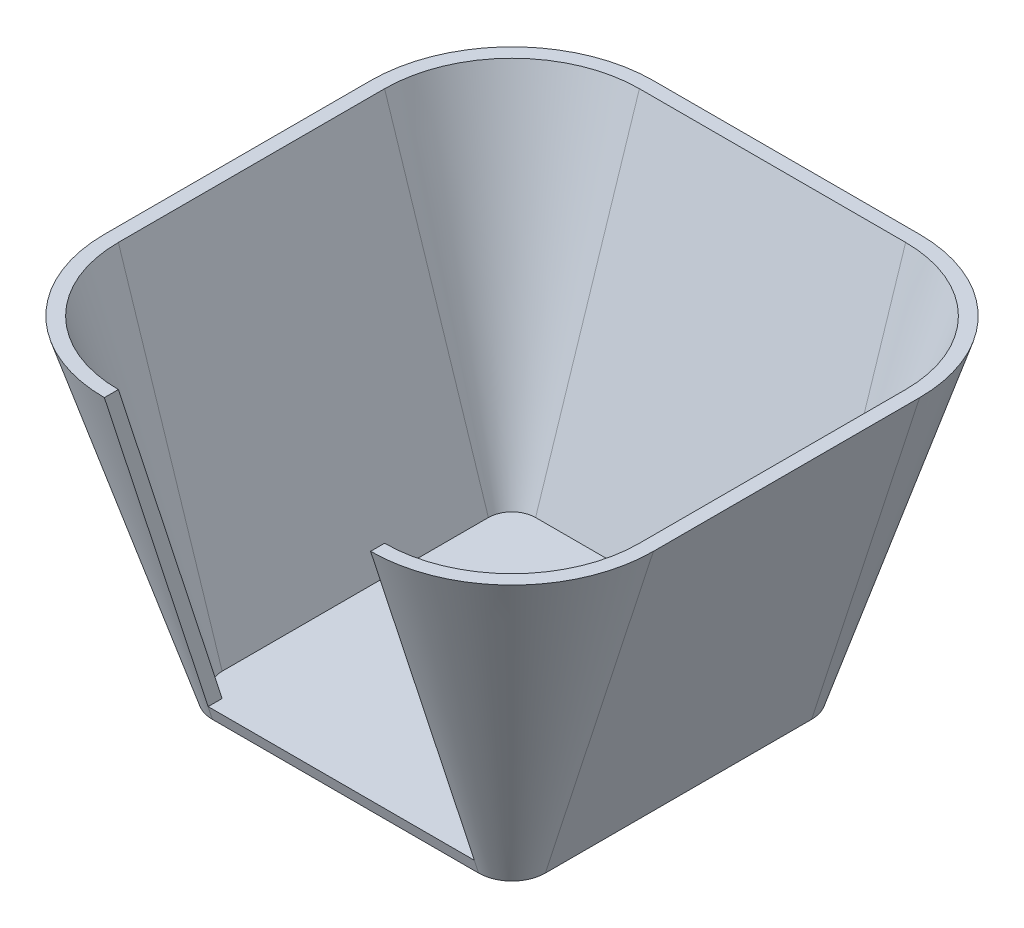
ISO-10303-21;
HEADER;
FILE_DESCRIPTION(('STEP AP214'),'2;1');
FILE_NAME('part.step','',(''),(''),'','','');
FILE_SCHEMA(('AUTOMOTIVE_DESIGN { 1 0 10303 214 1 1 1 1 }'));
ENDSEC;
DATA;
#1=APPLICATION_CONTEXT('core data for automotive mechanical design processes');
#2=APPLICATION_PROTOCOL_DEFINITION('international standard','automotive_design',2000,#1);
#3=PRODUCT_CONTEXT('',#1,'mechanical');
#4=PRODUCT('Part','Part','',(#3));
#5=PRODUCT_RELATED_PRODUCT_CATEGORY('part','',(#4));
#6=PRODUCT_DEFINITION_FORMATION('','',#4);
#7=PRODUCT_DEFINITION_CONTEXT('part definition',#1,'design');
#8=PRODUCT_DEFINITION('design','',#6,#7);
#9=PRODUCT_DEFINITION_SHAPE('','',#8);
#10=(LENGTH_UNIT() NAMED_UNIT(*) SI_UNIT(.MILLI.,.METRE.));
#11=(NAMED_UNIT(*) PLANE_ANGLE_UNIT() SI_UNIT($,.RADIAN.));
#12=(NAMED_UNIT(*) SI_UNIT($,.STERADIAN.) SOLID_ANGLE_UNIT());
#13=UNCERTAINTY_MEASURE_WITH_UNIT(LENGTH_MEASURE(1.E-05),#10,'distance_accuracy_value','');
#14=(GEOMETRIC_REPRESENTATION_CONTEXT(3) GLOBAL_UNCERTAINTY_ASSIGNED_CONTEXT((#13)) GLOBAL_UNIT_ASSIGNED_CONTEXT((#10,
#11,#12)) REPRESENTATION_CONTEXT('',''));
#15=CARTESIAN_POINT('',(0.,0.,0.));
#16=DIRECTION('',(0.,0.,1.));
#17=DIRECTION('',(1.,0.,0.));
#18=AXIS2_PLACEMENT_3D('',#15,#16,#17);
#19=CARTESIAN_POINT('',(-20.,0.,25.));
#20=DIRECTION('',(0.,-0.309016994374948,0.951056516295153));
#21=DIRECTION('',(0.,-0.951056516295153,-0.309016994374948));
#22=AXIS2_PLACEMENT_3D('',#19,#20,#21);
#23=PLANE('',#22);
#24=DIRECTION('',(-1.,0.,0.));
#25=VECTOR('',#24,1.);
#26=CARTESIAN_POINT('',(-20.,2.,25.6498393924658));
#27=LINE('',#26,#25);
#28=CARTESIAN_POINT('',(-20.,2.,25.6498393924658));
#29=VERTEX_POINT('',#28);
#30=CARTESIAN_POINT('',(20.,2.,25.6498393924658));
#31=VERTEX_POINT('',#30);
#32=EDGE_CURVE('E256',#29,#31,#27,.F.);
#33=ORIENTED_EDGE('',*,*,#32,.F.);
#34=DIRECTION('',(0.,0.951056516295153,0.309016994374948));
#35=VECTOR('',#34,1.);
#36=CARTESIAN_POINT('',(-20.,0.,25.));
#37=LINE('',#36,#35);
#38=CARTESIAN_POINT('',(-20.,0.,25.));
#39=VERTEX_POINT('',#38);
#40=EDGE_CURVE('E189',#29,#39,#37,.F.);
#41=ORIENTED_EDGE('',*,*,#40,.T.);
#42=DIRECTION('',(1.,0.,0.));
#43=VECTOR('',#42,1.);
#44=CARTESIAN_POINT('',(-20.,0.,25.));
#45=LINE('',#44,#43);
#46=CARTESIAN_POINT('',(20.,0.,25.));
#47=VERTEX_POINT('',#46);
#48=EDGE_CURVE('E226',#39,#47,#45,.T.);
#49=ORIENTED_EDGE('',*,*,#48,.T.);
#50=DIRECTION('',(0.,0.951056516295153,0.309016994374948));
#51=VECTOR('',#50,1.);
#52=CARTESIAN_POINT('',(20.,0.,25.));
#53=LINE('',#52,#51);
#54=EDGE_CURVE('E181',#31,#47,#53,.F.);
#55=ORIENTED_EDGE('',*,*,#54,.F.);
#56=EDGE_LOOP('',(#33,#41,#49,#55));
#57=FACE_BOUND('',#56,.T.);
#58=ADVANCED_FACE('F33',(#57),#23,.T.);
#59=CARTESIAN_POINT('',(-20.,0.,-20.));
#60=DIRECTION('',(0.,1.,0.));
#61=DIRECTION('',(0.,0.,1.));
#62=AXIS2_PLACEMENT_3D('',#59,#60,#61);
#63=CONICAL_SURFACE('',#62,5.,0.31415926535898);
#64=CARTESIAN_POINT('',(-20.,0.,-20.));
#65=DIRECTION('',(0.,1.,0.));
#66=DIRECTION('',(0.,0.,1.));
#67=AXIS2_PLACEMENT_3D('',#64,#65,#66);
#68=CIRCLE('',#67,5.);
#69=CARTESIAN_POINT('',(-20.,0.,-25.));
#70=VERTEX_POINT('',#69);
#71=CARTESIAN_POINT('',(-25.,0.,-20.));
#72=VERTEX_POINT('',#71);
#73=EDGE_CURVE('E218',#70,#72,#68,.T.);
#74=ORIENTED_EDGE('',*,*,#73,.T.);
#75=DIRECTION('',(-0.309016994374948,0.951056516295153,0.));
#76=VECTOR('',#75,1.);
#77=CARTESIAN_POINT('',(-25.,0.,-20.));
#78=LINE('',#77,#76);
#79=CARTESIAN_POINT('',(-41.2459848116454,50.,-20.));
#80=VERTEX_POINT('',#79);
#81=EDGE_CURVE('E11',#80,#72,#78,.F.);
#82=ORIENTED_EDGE('',*,*,#81,.F.);
#83=CARTESIAN_POINT('',(-20.,50.,-20.));
#84=DIRECTION('',(0.,1.,0.));
#85=DIRECTION('',(0.,0.,1.));
#86=AXIS2_PLACEMENT_3D('',#83,#84,#85);
#87=CIRCLE('',#86,21.2459848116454);
#88=CARTESIAN_POINT('',(-20.,50.,-41.2459848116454));
#89=VERTEX_POINT('',#88);
#90=EDGE_CURVE('E236',#89,#80,#87,.T.);
#91=ORIENTED_EDGE('',*,*,#90,.F.);
#92=DIRECTION('',(0.,0.951056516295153,-0.309016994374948));
#93=VECTOR('',#92,1.);
#94=CARTESIAN_POINT('',(-20.,0.,-25.));
#95=LINE('',#94,#93);
#96=EDGE_CURVE('E168',#89,#70,#95,.F.);
#97=ORIENTED_EDGE('',*,*,#96,.T.);
#98=EDGE_LOOP('',(#74,#82,#91,#97));
#99=FACE_BOUND('',#98,.T.);
#100=ADVANCED_FACE('F341',(#99),#63,.T.);
#101=CARTESIAN_POINT('',(-25.,0.,-20.));
#102=DIRECTION('',(-0.951056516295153,-0.309016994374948,0.));
#103=DIRECTION('',(0.309016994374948,-0.951056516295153,0.));
#104=AXIS2_PLACEMENT_3D('',#101,#102,#103);
#105=PLANE('',#104);
#106=DIRECTION('',(0.,0.,1.));
#107=VECTOR('',#106,1.);
#108=CARTESIAN_POINT('',(-25.,0.,-20.));
#109=LINE('',#108,#107);
#110=CARTESIAN_POINT('',(-25.,0.,20.));
#111=VERTEX_POINT('',#110);
#112=EDGE_CURVE('E221',#72,#111,#109,.T.);
#113=ORIENTED_EDGE('',*,*,#112,.T.);
#114=DIRECTION('',(-0.309016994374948,0.951056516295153,0.));
#115=VECTOR('',#114,1.);
#116=CARTESIAN_POINT('',(-25.,0.,20.));
#117=LINE('',#116,#115);
#118=CARTESIAN_POINT('',(-41.2459848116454,50.,20.));
#119=VERTEX_POINT('',#118);
#120=EDGE_CURVE('E43',#119,#111,#117,.F.);
#121=ORIENTED_EDGE('',*,*,#120,.F.);
#122=DIRECTION('',(0.,0.,-1.));
#123=VECTOR('',#122,1.);
#124=CARTESIAN_POINT('',(-41.2459848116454,50.,-20.));
#125=LINE('',#124,#123);
#126=EDGE_CURVE('E238',#80,#119,#125,.F.);
#127=ORIENTED_EDGE('',*,*,#126,.F.);
#128=ORIENTED_EDGE('',*,*,#81,.T.);
#129=EDGE_LOOP('',(#113,#121,#127,#128));
#130=FACE_BOUND('',#129,.T.);
#131=ADVANCED_FACE('F35',(#130),#105,.T.);
#132=CARTESIAN_POINT('',(-20.,0.,20.));
#133=DIRECTION('',(0.,1.,0.));
#134=DIRECTION('',(0.,0.,1.));
#135=AXIS2_PLACEMENT_3D('',#132,#133,#134);
#136=CONICAL_SURFACE('',#135,5.,0.31415926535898);
#137=CARTESIAN_POINT('',(-20.,0.,20.));
#138=DIRECTION('',(0.,1.,0.));
#139=DIRECTION('',(0.,0.,1.));
#140=AXIS2_PLACEMENT_3D('',#137,#138,#139);
#141=CIRCLE('',#140,5.);
#142=EDGE_CURVE('E223',#111,#39,#141,.T.);
#143=ORIENTED_EDGE('',*,*,#142,.T.);
#144=ORIENTED_EDGE('',*,*,#40,.F.);
#145=CARTESIAN_POINT('',(-20.,50.,41.2459848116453));
#146=VERTEX_POINT('',#145);
#147=EDGE_CURVE('E184',#146,#29,#37,.F.);
#148=ORIENTED_EDGE('',*,*,#147,.F.);
#149=CARTESIAN_POINT('',(-20.,50.,20.));
#150=DIRECTION('',(0.,1.,0.));
#151=DIRECTION('',(0.,0.,1.));
#152=AXIS2_PLACEMENT_3D('',#149,#150,#151);
#153=CIRCLE('',#152,21.2459848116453);
#154=EDGE_CURVE('E239',#119,#146,#153,.T.);
#155=ORIENTED_EDGE('',*,*,#154,.F.);
#156=ORIENTED_EDGE('',*,*,#120,.T.);
#157=EDGE_LOOP('',(#143,#144,#148,#155,#156));
#158=FACE_BOUND('',#157,.T.);
#159=ADVANCED_FACE('F248',(#158),#136,.T.);
#160=CARTESIAN_POINT('',(20.,0.,20.));
#161=DIRECTION('',(0.,1.,0.));
#162=DIRECTION('',(0.,0.,1.));
#163=AXIS2_PLACEMENT_3D('',#160,#161,#162);
#164=CONICAL_SURFACE('',#163,5.,0.31415926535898);
#165=CARTESIAN_POINT('',(20.,0.,20.));
#166=DIRECTION('',(0.,1.,0.));
#167=DIRECTION('',(0.,0.,1.));
#168=AXIS2_PLACEMENT_3D('',#165,#166,#167);
#169=CIRCLE('',#168,5.);
#170=CARTESIAN_POINT('',(25.,0.,20.));
#171=VERTEX_POINT('',#170);
#172=EDGE_CURVE('E229',#47,#171,#169,.T.);
#173=ORIENTED_EDGE('',*,*,#172,.T.);
#174=DIRECTION('',(0.309016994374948,0.951056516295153,0.));
#175=VECTOR('',#174,1.);
#176=CARTESIAN_POINT('',(25.,0.,20.));
#177=LINE('',#176,#175);
#178=CARTESIAN_POINT('',(41.2459848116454,50.,20.));
#179=VERTEX_POINT('',#178);
#180=EDGE_CURVE('E178',#179,#171,#177,.F.);
#181=ORIENTED_EDGE('',*,*,#180,.F.);
#182=CARTESIAN_POINT('',(20.,50.,20.));
#183=DIRECTION('',(0.,1.,0.));
#184=DIRECTION('',(0.,0.,1.));
#185=AXIS2_PLACEMENT_3D('',#182,#183,#184);
#186=CIRCLE('',#185,21.2459848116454);
#187=CARTESIAN_POINT('',(20.,50.,41.2459848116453));
#188=VERTEX_POINT('',#187);
#189=EDGE_CURVE('E190',#188,#179,#186,.T.);
#190=ORIENTED_EDGE('',*,*,#189,.F.);
#191=EDGE_CURVE('E185',#188,#31,#53,.F.);
#192=ORIENTED_EDGE('',*,*,#191,.T.);
#193=ORIENTED_EDGE('',*,*,#54,.T.);
#194=EDGE_LOOP('',(#173,#181,#190,#192,#193));
#195=FACE_BOUND('',#194,.T.);
#196=ADVANCED_FACE('F349',(#195),#164,.T.);
#197=CARTESIAN_POINT('',(25.,0.,-20.));
#198=DIRECTION('',(0.951056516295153,-0.309016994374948,0.));
#199=DIRECTION('',(0.309016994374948,0.951056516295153,0.));
#200=AXIS2_PLACEMENT_3D('',#197,#198,#199);
#201=PLANE('',#200);
#202=DIRECTION('',(0.,0.,-1.));
#203=VECTOR('',#202,1.);
#204=CARTESIAN_POINT('',(25.,0.,-20.));
#205=LINE('',#204,#203);
#206=CARTESIAN_POINT('',(25.,0.,-20.));
#207=VERTEX_POINT('',#206);
#208=EDGE_CURVE('E231',#171,#207,#205,.T.);
#209=ORIENTED_EDGE('',*,*,#208,.T.);
#210=DIRECTION('',(0.309016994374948,0.951056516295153,0.));
#211=VECTOR('',#210,1.);
#212=CARTESIAN_POINT('',(25.,0.,-20.));
#213=LINE('',#212,#211);
#214=CARTESIAN_POINT('',(41.2459848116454,50.,-20.));
#215=VERTEX_POINT('',#214);
#216=EDGE_CURVE('E167',#215,#207,#213,.F.);
#217=ORIENTED_EDGE('',*,*,#216,.F.);
#218=DIRECTION('',(0.,0.,1.));
#219=VECTOR('',#218,1.);
#220=CARTESIAN_POINT('',(41.2459848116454,50.,-20.));
#221=LINE('',#220,#219);
#222=EDGE_CURVE('E155',#179,#215,#221,.F.);
#223=ORIENTED_EDGE('',*,*,#222,.F.);
#224=ORIENTED_EDGE('',*,*,#180,.T.);
#225=EDGE_LOOP('',(#209,#217,#223,#224));
#226=FACE_BOUND('',#225,.T.);
#227=ADVANCED_FACE('F356',(#226),#201,.T.);
#228=CARTESIAN_POINT('',(20.,0.,-20.));
#229=DIRECTION('',(0.,1.,0.));
#230=DIRECTION('',(0.,0.,-1.));
#231=AXIS2_PLACEMENT_3D('',#228,#229,#230);
#232=CONICAL_SURFACE('',#231,5.,0.31415926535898);
#233=CARTESIAN_POINT('',(20.,0.,-20.));
#234=DIRECTION('',(0.,1.,0.));
#235=DIRECTION('',(0.,0.,-1.));
#236=AXIS2_PLACEMENT_3D('',#233,#234,#235);
#237=CIRCLE('',#236,5.);
#238=CARTESIAN_POINT('',(20.,0.,-25.));
#239=VERTEX_POINT('',#238);
#240=EDGE_CURVE('E164',#207,#239,#237,.T.);
#241=ORIENTED_EDGE('',*,*,#240,.T.);
#242=DIRECTION('',(0.,0.951056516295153,-0.309016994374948));
#243=VECTOR('',#242,1.);
#244=CARTESIAN_POINT('',(20.,0.,-25.));
#245=LINE('',#244,#243);
#246=CARTESIAN_POINT('',(20.,50.,-41.2459848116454));
#247=VERTEX_POINT('',#246);
#248=EDGE_CURVE('E161',#247,#239,#245,.F.);
#249=ORIENTED_EDGE('',*,*,#248,.F.);
#250=CARTESIAN_POINT('',(20.,50.,-20.));
#251=DIRECTION('',(0.,1.,0.));
#252=DIRECTION('',(0.,0.,1.));
#253=AXIS2_PLACEMENT_3D('',#250,#251,#252);
#254=CIRCLE('',#253,21.2459848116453);
#255=EDGE_CURVE('E146',#215,#247,#254,.T.);
#256=ORIENTED_EDGE('',*,*,#255,.F.);
#257=ORIENTED_EDGE('',*,*,#216,.T.);
#258=EDGE_LOOP('',(#241,#249,#256,#257));
#259=FACE_BOUND('',#258,.T.);
#260=ADVANCED_FACE('F162',(#259),#232,.T.);
#261=CARTESIAN_POINT('',(-20.,0.,-25.));
#262=DIRECTION('',(0.,-0.309016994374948,-0.951056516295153));
#263=DIRECTION('',(0.,0.951056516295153,-0.309016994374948));
#264=AXIS2_PLACEMENT_3D('',#261,#262,#263);
#265=PLANE('',#264);
#266=DIRECTION('',(-1.,0.,0.));
#267=VECTOR('',#266,1.);
#268=CARTESIAN_POINT('',(-20.,0.,-25.));
#269=LINE('',#268,#267);
#270=EDGE_CURVE('E234',#239,#70,#269,.T.);
#271=ORIENTED_EDGE('',*,*,#270,.T.);
#272=ORIENTED_EDGE('',*,*,#96,.F.);
#273=DIRECTION('',(1.,0.,0.));
#274=VECTOR('',#273,1.);
#275=CARTESIAN_POINT('',(-20.,50.,-41.2459848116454));
#276=LINE('',#275,#274);
#277=EDGE_CURVE('E152',#247,#89,#276,.F.);
#278=ORIENTED_EDGE('',*,*,#277,.F.);
#279=ORIENTED_EDGE('',*,*,#248,.T.);
#280=EDGE_LOOP('',(#271,#272,#278,#279));
#281=FACE_BOUND('',#280,.T.);
#282=ADVANCED_FACE('F170',(#281),#265,.T.);
#283=CARTESIAN_POINT('',(-20.,50.,-20.));
#284=DIRECTION('',(0.,1.,0.));
#285=DIRECTION('',(0.,0.,1.));
#286=AXIS2_PLACEMENT_3D('',#283,#284,#285);
#287=PLANE('',#286);
#288=DIRECTION('',(0.,0.,-1.));
#289=VECTOR('',#288,1.);
#290=CARTESIAN_POINT('',(-20.,50.,41.2459848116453));
#291=LINE('',#290,#289);
#292=CARTESIAN_POINT('',(-20.,50.,39.1430603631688));
#293=VERTEX_POINT('',#292);
#294=EDGE_CURVE('E37',#293,#146,#291,.F.);
#295=ORIENTED_EDGE('',*,*,#294,.F.);
#296=CARTESIAN_POINT('',(-20.,50.,20.));
#297=DIRECTION('',(0.,1.,0.));
#298=DIRECTION('',(0.,0.,1.));
#299=AXIS2_PLACEMENT_3D('',#296,#297,#298);
#300=CIRCLE('',#299,19.1430603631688);
#301=CARTESIAN_POINT('',(-39.1430603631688,50.,20.));
#302=VERTEX_POINT('',#301);
#303=EDGE_CURVE('E74',#302,#293,#300,.T.);
#304=ORIENTED_EDGE('',*,*,#303,.F.);
#305=DIRECTION('',(0.,0.,-1.));
#306=VECTOR('',#305,1.);
#307=CARTESIAN_POINT('',(-39.1430603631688,50.,-20.));
#308=LINE('',#307,#306);
#309=CARTESIAN_POINT('',(-39.1430603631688,50.,-20.));
#310=VERTEX_POINT('',#309);
#311=EDGE_CURVE('E83',#310,#302,#308,.F.);
#312=ORIENTED_EDGE('',*,*,#311,.F.);
#313=CARTESIAN_POINT('',(-20.,50.,-20.));
#314=DIRECTION('',(0.,1.,0.));
#315=DIRECTION('',(0.,0.,1.));
#316=AXIS2_PLACEMENT_3D('',#313,#314,#315);
#317=CIRCLE('',#316,19.1430603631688);
#318=CARTESIAN_POINT('',(-20.,50.,-39.1430603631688));
#319=VERTEX_POINT('',#318);
#320=EDGE_CURVE('E293',#319,#310,#317,.T.);
#321=ORIENTED_EDGE('',*,*,#320,.F.);
#322=DIRECTION('',(1.,0.,0.));
#323=VECTOR('',#322,1.);
#324=CARTESIAN_POINT('',(-20.,50.,-39.1430603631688));
#325=LINE('',#324,#323);
#326=CARTESIAN_POINT('',(20.,50.,-39.1430603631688));
#327=VERTEX_POINT('',#326);
#328=EDGE_CURVE('E273',#327,#319,#325,.F.);
#329=ORIENTED_EDGE('',*,*,#328,.F.);
#330=CARTESIAN_POINT('',(20.,50.,-20.));
#331=DIRECTION('',(0.,1.,0.));
#332=DIRECTION('',(0.,0.,1.));
#333=AXIS2_PLACEMENT_3D('',#330,#331,#332);
#334=CIRCLE('',#333,19.1430603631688);
#335=CARTESIAN_POINT('',(39.1430603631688,50.,-20.));
#336=VERTEX_POINT('',#335);
#337=EDGE_CURVE('E272',#336,#327,#334,.T.);
#338=ORIENTED_EDGE('',*,*,#337,.F.);
#339=DIRECTION('',(0.,0.,1.));
#340=VECTOR('',#339,1.);
#341=CARTESIAN_POINT('',(39.1430603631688,50.,-20.));
#342=LINE('',#341,#340);
#343=CARTESIAN_POINT('',(39.1430603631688,50.,20.));
#344=VERTEX_POINT('',#343);
#345=EDGE_CURVE('E217',#344,#336,#342,.F.);
#346=ORIENTED_EDGE('',*,*,#345,.F.);
#347=CARTESIAN_POINT('',(20.,50.,20.));
#348=DIRECTION('',(0.,1.,0.));
#349=DIRECTION('',(0.,0.,1.));
#350=AXIS2_PLACEMENT_3D('',#347,#348,#349);
#351=CIRCLE('',#350,19.1430603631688);
#352=CARTESIAN_POINT('',(20.,50.,39.1430603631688));
#353=VERTEX_POINT('',#352);
#354=EDGE_CURVE('E215',#353,#344,#351,.T.);
#355=ORIENTED_EDGE('',*,*,#354,.F.);
#356=DIRECTION('',(0.,0.,1.));
#357=VECTOR('',#356,1.);
#358=CARTESIAN_POINT('',(20.,50.,-20.));
#359=LINE('',#358,#357);
#360=EDGE_CURVE('E196',#353,#188,#359,.T.);
#361=ORIENTED_EDGE('',*,*,#360,.T.);
#362=ORIENTED_EDGE('',*,*,#189,.T.);
#363=ORIENTED_EDGE('',*,*,#222,.T.);
#364=ORIENTED_EDGE('',*,*,#255,.T.);
#365=ORIENTED_EDGE('',*,*,#277,.T.);
#366=ORIENTED_EDGE('',*,*,#90,.T.);
#367=ORIENTED_EDGE('',*,*,#126,.T.);
#368=ORIENTED_EDGE('',*,*,#154,.T.);
#369=EDGE_LOOP('',(#295,#304,#312,#321,#329,#338,#346,#355,#361,#362,#363,#364,#365,#366,#367,#368));
#370=FACE_BOUND('',#369,.T.);
#371=ADVANCED_FACE('F149',(#370),#287,.T.);
#372=CARTESIAN_POINT('',(-20.,0.,-20.));
#373=DIRECTION('',(0.,1.,0.));
#374=DIRECTION('',(0.,0.,1.));
#375=AXIS2_PLACEMENT_3D('',#372,#373,#374);
#376=PLANE('',#375);
#377=ORIENTED_EDGE('',*,*,#73,.F.);
#378=ORIENTED_EDGE('',*,*,#270,.F.);
#379=ORIENTED_EDGE('',*,*,#240,.F.);
#380=ORIENTED_EDGE('',*,*,#208,.F.);
#381=ORIENTED_EDGE('',*,*,#172,.F.);
#382=ORIENTED_EDGE('',*,*,#48,.F.);
#383=ORIENTED_EDGE('',*,*,#142,.F.);
#384=ORIENTED_EDGE('',*,*,#112,.F.);
#385=EDGE_LOOP('',(#377,#378,#379,#380,#381,#382,#383,#384));
#386=FACE_BOUND('',#385,.T.);
#387=ADVANCED_FACE('F366',(#386),#376,.F.);
#388=CARTESIAN_POINT('',(-20.,0.,25.));
#389=DIRECTION('',(1.,0.,0.));
#390=DIRECTION('',(0.,0.951056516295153,0.309016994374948));
#391=AXIS2_PLACEMENT_3D('',#388,#389,#390);
#392=PLANE('',#391);
#393=ORIENTED_EDGE('',*,*,#147,.T.);
#394=DIRECTION('',(0.,0.,-1.));
#395=VECTOR('',#394,1.);
#396=CARTESIAN_POINT('',(-20.,2.,-20.));
#397=LINE('',#396,#395);
#398=CARTESIAN_POINT('',(-20.,2.,23.5469149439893));
#399=VERTEX_POINT('',#398);
#400=EDGE_CURVE('E203',#399,#29,#397,.F.);
#401=ORIENTED_EDGE('',*,*,#400,.F.);
#402=DIRECTION('',(0.,-0.951056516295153,-0.309016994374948));
#403=VECTOR('',#402,1.);
#404=CARTESIAN_POINT('',(-20.,-8.91628173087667,20.));
#405=LINE('',#404,#403);
#406=EDGE_CURVE('E199',#293,#399,#405,.T.);
#407=ORIENTED_EDGE('',*,*,#406,.F.);
#408=ORIENTED_EDGE('',*,*,#294,.T.);
#409=EDGE_LOOP('',(#393,#401,#407,#408));
#410=FACE_BOUND('',#409,.T.);
#411=ADVANCED_FACE('F251',(#410),#392,.T.);
#412=CARTESIAN_POINT('',(20.,0.,25.));
#413=DIRECTION('',(1.,0.,0.));
#414=DIRECTION('',(0.,0.951056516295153,0.309016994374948));
#415=AXIS2_PLACEMENT_3D('',#412,#413,#414);
#416=PLANE('',#415);
#417=ORIENTED_EDGE('',*,*,#191,.F.);
#418=ORIENTED_EDGE('',*,*,#360,.F.);
#419=DIRECTION('',(0.,-0.951056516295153,-0.309016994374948));
#420=VECTOR('',#419,1.);
#421=CARTESIAN_POINT('',(20.,-8.91628173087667,20.));
#422=LINE('',#421,#420);
#423=CARTESIAN_POINT('',(20.,2.,23.5469149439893));
#424=VERTEX_POINT('',#423);
#425=EDGE_CURVE('E205',#353,#424,#422,.T.);
#426=ORIENTED_EDGE('',*,*,#425,.T.);
#427=DIRECTION('',(0.,0.,1.));
#428=VECTOR('',#427,1.);
#429=CARTESIAN_POINT('',(20.,2.,25.));
#430=LINE('',#429,#428);
#431=EDGE_CURVE('E198',#424,#31,#430,.T.);
#432=ORIENTED_EDGE('',*,*,#431,.T.);
#433=EDGE_LOOP('',(#417,#418,#426,#432));
#434=FACE_BOUND('',#433,.T.);
#435=ADVANCED_FACE('F384',(#434),#416,.F.);
#436=CARTESIAN_POINT('',(-20.,0.618033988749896,-20.));
#437=DIRECTION('',(0.,1.,0.));
#438=DIRECTION('',(0.,0.,1.));
#439=AXIS2_PLACEMENT_3D('',#436,#437,#438);
#440=CONICAL_SURFACE('',#439,3.09788696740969,0.31415926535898);
#441=CARTESIAN_POINT('',(-20.,2.,-20.));
#442=DIRECTION('',(0.,1.,0.));
#443=DIRECTION('',(0.,0.,1.));
#444=AXIS2_PLACEMENT_3D('',#441,#442,#443);
#445=CIRCLE('',#444,3.54691494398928);
#446=CARTESIAN_POINT('',(-20.,2.,-23.5469149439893));
#447=VERTEX_POINT('',#446);
#448=CARTESIAN_POINT('',(-23.5469149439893,2.,-20.));
#449=VERTEX_POINT('',#448);
#450=EDGE_CURVE('E286',#447,#449,#445,.T.);
#451=ORIENTED_EDGE('',*,*,#450,.F.);
#452=DIRECTION('',(0.,0.951056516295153,-0.309016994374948));
#453=VECTOR('',#452,1.);
#454=CARTESIAN_POINT('',(-20.,0.618033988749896,-23.0978869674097));
#455=LINE('',#454,#453);
#456=EDGE_CURVE('E274',#319,#447,#455,.F.);
#457=ORIENTED_EDGE('',*,*,#456,.F.);
#458=ORIENTED_EDGE('',*,*,#320,.T.);
#459=DIRECTION('',(0.309016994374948,-0.951056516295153,0.));
#460=VECTOR('',#459,1.);
#461=CARTESIAN_POINT('',(-23.0978869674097,0.618033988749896,-20.));
#462=LINE('',#461,#460);
#463=EDGE_CURVE('E210',#310,#449,#462,.T.);
#464=ORIENTED_EDGE('',*,*,#463,.T.);
#465=EDGE_LOOP('',(#451,#457,#458,#464));
#466=FACE_BOUND('',#465,.T.);
#467=ADVANCED_FACE('F306',(#466),#440,.F.);
#468=CARTESIAN_POINT('',(-23.0978869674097,0.618033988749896,-20.));
#469=DIRECTION('',(-0.951056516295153,-0.309016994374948,0.));
#470=DIRECTION('',(0.309016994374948,-0.951056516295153,0.));
#471=AXIS2_PLACEMENT_3D('',#468,#469,#470);
#472=PLANE('',#471);
#473=DIRECTION('',(0.,0.,-1.));
#474=VECTOR('',#473,1.);
#475=CARTESIAN_POINT('',(-23.5469149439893,2.,-20.));
#476=LINE('',#475,#474);
#477=CARTESIAN_POINT('',(-23.5469149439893,2.,20.));
#478=VERTEX_POINT('',#477);
#479=EDGE_CURVE('E267',#449,#478,#476,.F.);
#480=ORIENTED_EDGE('',*,*,#479,.F.);
#481=ORIENTED_EDGE('',*,*,#463,.F.);
#482=ORIENTED_EDGE('',*,*,#311,.T.);
#483=DIRECTION('',(-0.309016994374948,0.951056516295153,0.));
#484=VECTOR('',#483,1.);
#485=CARTESIAN_POINT('',(-23.0978869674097,0.618033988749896,20.));
#486=LINE('',#485,#484);
#487=EDGE_CURVE('E287',#302,#478,#486,.F.);
#488=ORIENTED_EDGE('',*,*,#487,.T.);
#489=EDGE_LOOP('',(#480,#481,#482,#488));
#490=FACE_BOUND('',#489,.T.);
#491=ADVANCED_FACE('F309',(#490),#472,.F.);
#492=CARTESIAN_POINT('',(-20.,0.618033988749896,20.));
#493=DIRECTION('',(0.,1.,0.));
#494=DIRECTION('',(0.,0.,1.));
#495=AXIS2_PLACEMENT_3D('',#492,#493,#494);
#496=CONICAL_SURFACE('',#495,3.09788696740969,0.31415926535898);
#497=CARTESIAN_POINT('',(-20.,2.,20.));
#498=DIRECTION('',(0.,1.,0.));
#499=DIRECTION('',(0.,0.,1.));
#500=AXIS2_PLACEMENT_3D('',#497,#498,#499);
#501=CIRCLE('',#500,3.54691494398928);
#502=EDGE_CURVE('E258',#478,#399,#501,.T.);
#503=ORIENTED_EDGE('',*,*,#502,.F.);
#504=ORIENTED_EDGE('',*,*,#487,.F.);
#505=ORIENTED_EDGE('',*,*,#303,.T.);
#506=ORIENTED_EDGE('',*,*,#406,.T.);
#507=EDGE_LOOP('',(#503,#504,#505,#506));
#508=FACE_BOUND('',#507,.T.);
#509=ADVANCED_FACE('F396',(#508),#496,.F.);
#510=CARTESIAN_POINT('',(20.,0.618033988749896,20.));
#511=DIRECTION('',(0.,1.,0.));
#512=DIRECTION('',(0.,0.,1.));
#513=AXIS2_PLACEMENT_3D('',#510,#511,#512);
#514=CONICAL_SURFACE('',#513,3.09788696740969,0.31415926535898);
#515=CARTESIAN_POINT('',(20.,2.,20.));
#516=DIRECTION('',(0.,1.,0.));
#517=DIRECTION('',(0.,0.,1.));
#518=AXIS2_PLACEMENT_3D('',#515,#516,#517);
#519=CIRCLE('',#518,3.54691494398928);
#520=CARTESIAN_POINT('',(23.5469149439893,2.,20.));
#521=VERTEX_POINT('',#520);
#522=EDGE_CURVE('E262',#424,#521,#519,.T.);
#523=ORIENTED_EDGE('',*,*,#522,.F.);
#524=ORIENTED_EDGE('',*,*,#425,.F.);
#525=ORIENTED_EDGE('',*,*,#354,.T.);
#526=DIRECTION('',(0.309016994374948,0.951056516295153,0.));
#527=VECTOR('',#526,1.);
#528=CARTESIAN_POINT('',(23.0978869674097,0.618033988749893,20.));
#529=LINE('',#528,#527);
#530=EDGE_CURVE('E288',#344,#521,#529,.F.);
#531=ORIENTED_EDGE('',*,*,#530,.T.);
#532=EDGE_LOOP('',(#523,#524,#525,#531));
#533=FACE_BOUND('',#532,.T.);
#534=ADVANCED_FACE('F322',(#533),#514,.F.);
#535=CARTESIAN_POINT('',(23.0978869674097,0.618033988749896,-20.));
#536=DIRECTION('',(0.951056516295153,-0.309016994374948,0.));
#537=DIRECTION('',(0.309016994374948,0.951056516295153,0.));
#538=AXIS2_PLACEMENT_3D('',#535,#536,#537);
#539=PLANE('',#538);
#540=DIRECTION('',(0.,0.,1.));
#541=VECTOR('',#540,1.);
#542=CARTESIAN_POINT('',(23.5469149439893,2.,-20.));
#543=LINE('',#542,#541);
#544=CARTESIAN_POINT('',(23.5469149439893,2.,-20.));
#545=VERTEX_POINT('',#544);
#546=EDGE_CURVE('E265',#521,#545,#543,.F.);
#547=ORIENTED_EDGE('',*,*,#546,.F.);
#548=ORIENTED_EDGE('',*,*,#530,.F.);
#549=ORIENTED_EDGE('',*,*,#345,.T.);
#550=DIRECTION('',(0.309016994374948,0.951056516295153,0.));
#551=VECTOR('',#550,1.);
#552=CARTESIAN_POINT('',(23.0978869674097,0.618033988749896,-20.));
#553=LINE('',#552,#551);
#554=EDGE_CURVE('E280',#336,#545,#553,.F.);
#555=ORIENTED_EDGE('',*,*,#554,.T.);
#556=EDGE_LOOP('',(#547,#548,#549,#555));
#557=FACE_BOUND('',#556,.T.);
#558=ADVANCED_FACE('F325',(#557),#539,.F.);
#559=CARTESIAN_POINT('',(20.,0.618033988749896,-20.));
#560=DIRECTION('',(0.,1.,0.));
#561=DIRECTION('',(0.,0.,-1.));
#562=AXIS2_PLACEMENT_3D('',#559,#560,#561);
#563=CONICAL_SURFACE('',#562,3.09788696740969,0.31415926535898);
#564=CARTESIAN_POINT('',(20.,2.,-20.));
#565=DIRECTION('',(0.,1.,0.));
#566=DIRECTION('',(0.,0.,1.));
#567=AXIS2_PLACEMENT_3D('',#564,#565,#566);
#568=CIRCLE('',#567,3.54691494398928);
#569=CARTESIAN_POINT('',(20.,2.,-23.5469149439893));
#570=VERTEX_POINT('',#569);
#571=EDGE_CURVE('E294',#545,#570,#568,.T.);
#572=ORIENTED_EDGE('',*,*,#571,.F.);
#573=ORIENTED_EDGE('',*,*,#554,.F.);
#574=ORIENTED_EDGE('',*,*,#337,.T.);
#575=DIRECTION('',(0.,0.951056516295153,-0.309016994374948));
#576=VECTOR('',#575,1.);
#577=CARTESIAN_POINT('',(20.,0.618033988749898,-23.0978869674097));
#578=LINE('',#577,#576);
#579=EDGE_CURVE('E52',#327,#570,#578,.F.);
#580=ORIENTED_EDGE('',*,*,#579,.T.);
#581=EDGE_LOOP('',(#572,#573,#574,#580));
#582=FACE_BOUND('',#581,.T.);
#583=ADVANCED_FACE('F330',(#582),#563,.F.);
#584=CARTESIAN_POINT('',(-20.,0.618033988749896,-23.0978869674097));
#585=DIRECTION('',(0.,-0.309016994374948,-0.951056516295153));
#586=DIRECTION('',(0.,0.951056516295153,-0.309016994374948));
#587=AXIS2_PLACEMENT_3D('',#584,#585,#586);
#588=PLANE('',#587);
#589=DIRECTION('',(1.,0.,0.));
#590=VECTOR('',#589,1.);
#591=CARTESIAN_POINT('',(-20.,2.,-23.5469149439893));
#592=LINE('',#591,#590);
#593=EDGE_CURVE('E290',#570,#447,#592,.F.);
#594=ORIENTED_EDGE('',*,*,#593,.F.);
#595=ORIENTED_EDGE('',*,*,#579,.F.);
#596=ORIENTED_EDGE('',*,*,#328,.T.);
#597=ORIENTED_EDGE('',*,*,#456,.T.);
#598=EDGE_LOOP('',(#594,#595,#596,#597));
#599=FACE_BOUND('',#598,.T.);
#600=ADVANCED_FACE('F331',(#599),#588,.F.);
#601=CARTESIAN_POINT('',(-20.,2.,-20.));
#602=DIRECTION('',(0.,1.,0.));
#603=DIRECTION('',(0.,0.,1.));
#604=AXIS2_PLACEMENT_3D('',#601,#602,#603);
#605=PLANE('',#604);
#606=ORIENTED_EDGE('',*,*,#450,.T.);
#607=ORIENTED_EDGE('',*,*,#479,.T.);
#608=ORIENTED_EDGE('',*,*,#502,.T.);
#609=ORIENTED_EDGE('',*,*,#400,.T.);
#610=ORIENTED_EDGE('',*,*,#32,.T.);
#611=ORIENTED_EDGE('',*,*,#431,.F.);
#612=ORIENTED_EDGE('',*,*,#522,.T.);
#613=ORIENTED_EDGE('',*,*,#546,.T.);
#614=ORIENTED_EDGE('',*,*,#571,.T.);
#615=ORIENTED_EDGE('',*,*,#593,.T.);
#616=EDGE_LOOP('',(#606,#607,#608,#609,#610,#611,#612,#613,#614,#615));
#617=FACE_BOUND('',#616,.T.);
#618=ADVANCED_FACE('F255',(#617),#605,.T.);
#619=CLOSED_SHELL('',(#58,#100,#131,#159,#196,#227,#260,#282,#371,#387,#411,#435,#467,#491,#509,
#534,#558,#583,#600,#618));
#620=MANIFOLD_SOLID_BREP('B2',#619);
#621=ADVANCED_BREP_SHAPE_REPRESENTATION('',(#18,#620),#14);
#622=SHAPE_DEFINITION_REPRESENTATION(#9,#621);
ENDSEC;
END-ISO-10303-21;
